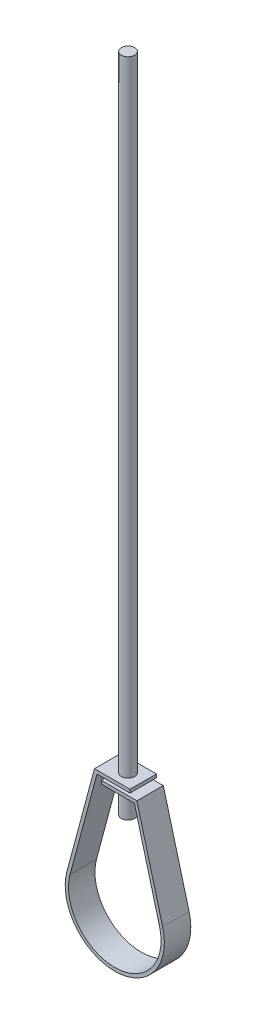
from build123d import *

# Parameters (mm, degrees)
EXTRUDE_THIN1_DEPTH = 12.7
EXTRUDE2_DEPTH      = 609.6
EXTRUDE2_DEPTH_BACK = 25.4
SKETCH2_R           = 6.35


with BuildPart() as part:
    # Sketch1 → Extrude-Thin1 (new, symmetric)
    with BuildSketch(Plane.XY):
        with BuildLine():
            Line((-12.955611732, 101.6), (18.794388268, 101.6))
            Line((18.794388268, 101.6), (42.935402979, 11.504506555))
            ThreePointArc((42.935402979, 11.504506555), (0, -44.45), (-42.935402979, 11.504506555))
            Line((-42.935402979, 11.504506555), (-17.092910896, 107.95))
            Line((-17.092910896, 107.95), (14.657089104, 107.95))
            Line((14.657089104, 107.95), (14.657089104, 111.125))
            Line((14.657089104, 111.125), (-19.529174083, 111.125))
            Line((-19.529174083, 111.125), (-46.002217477, 12.326257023))
            ThreePointArc((-46.002217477, 12.326257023), (0, -47.625), (46.002217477, 12.326257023))
            Line((46.002217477, 12.326257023), (21.230651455, 104.775))
            Line((21.230651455, 104.775), (-12.955611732, 104.775))
            Line((-12.955611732, 104.775), (-12.955611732, 101.6))
        make_face()
    extrude(amount=EXTRUDE_THIN1_DEPTH, both=True)

    # Sketch2 → Extrude2 (add, two sides: drawn at the far end of the back side and taken through both)
    with BuildSketch(Plane(origin=(0, 101.6, 0), x_dir=(1, 0, 0), z_dir=(0, 1, 0)).offset(-EXTRUDE2_DEPTH_BACK)):
        with Locations(Location((0, 0, 0), (0, 0, 90))):
            Circle(SKETCH2_R)
    extrude(amount=EXTRUDE2_DEPTH + EXTRUDE2_DEPTH_BACK)


solid = part.part
